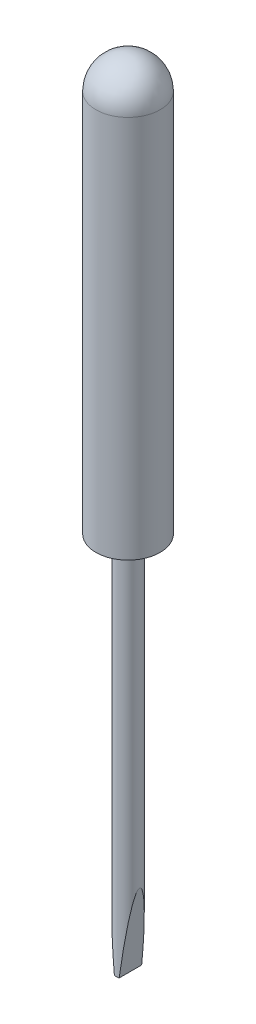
from build123d import *

# Parameters (mm, degrees)
SKETCH1_R               = 1.524
BOSS_EXTRUDE1_DEPTH     = 50
SKETCH2_R               = 4.25
BOSS_EXTRUDE2_DEPTH     = 50.75
DOME1_FACE_RADIUS       = 4.25
DOME1_HEIGHT            = 4.25
CUT_EXTRUDE1_DEPTH      = 106.171883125
CUT_EXTRUDE1_DEPTH_BACK = 106.171883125


with BuildPart() as part:
    # Sketch1 → Boss-Extrude1 (new body)
    with BuildSketch(Plane(origin=(0, 0, 0), x_dir=(1, 0, 0), z_dir=(0, 1, 0))):
        with Locations(Location((0, 0, 0), (0, 0, 270))):
            Circle(SKETCH1_R)
    extrude(amount=BOSS_EXTRUDE1_DEPTH)

    # Sketch2 → Boss-Extrude2 (add)
    with BuildSketch(Plane(origin=(0, 50, 0), x_dir=(1, 0, 0), z_dir=(0, 1, 0))):
        with Locations(Location((0, 0, 0), (0, 0, 90))):
            Circle(SKETCH2_R)
    extrude(amount=BOSS_EXTRUDE2_DEPTH)

    # Dome1: a dome of height H over a round flat face of radius A is a cap of a sphere of radius (A * A + H * H) / (2 * H)
    dome1_r = (DOME1_FACE_RADIUS * DOME1_FACE_RADIUS + DOME1_HEIGHT * DOME1_HEIGHT) / (2 * DOME1_HEIGHT)
    dome1_base = Plane((0, 100.75, 0), z_dir=(0, 1, 0))
    with Locations(dome1_base.offset(DOME1_HEIGHT - dome1_r)):
        dome1_ball = Sphere(dome1_r, mode=Mode.PRIVATE)
    add(split(dome1_ball, bisect_by=dome1_base, keep=Keep.TOP, mode=Mode.PRIVATE))

    # Sketch3 → Cut-Extrude1 (cut, two sides: drawn at the far end of the back side and taken through both)
    with BuildSketch(Plane.XY.offset(-CUT_EXTRUDE1_DEPTH_BACK)):
        Polygon((-1.524, 10.16), (-1.524, 0), (-0.3175, 0), align=None)
        Polygon((0.3175, 0), (1.524, 10.16), (1.524, 0), align=None)
    extrude(amount=CUT_EXTRUDE1_DEPTH + CUT_EXTRUDE1_DEPTH_BACK, mode=Mode.SUBTRACT)


solid = part.part
